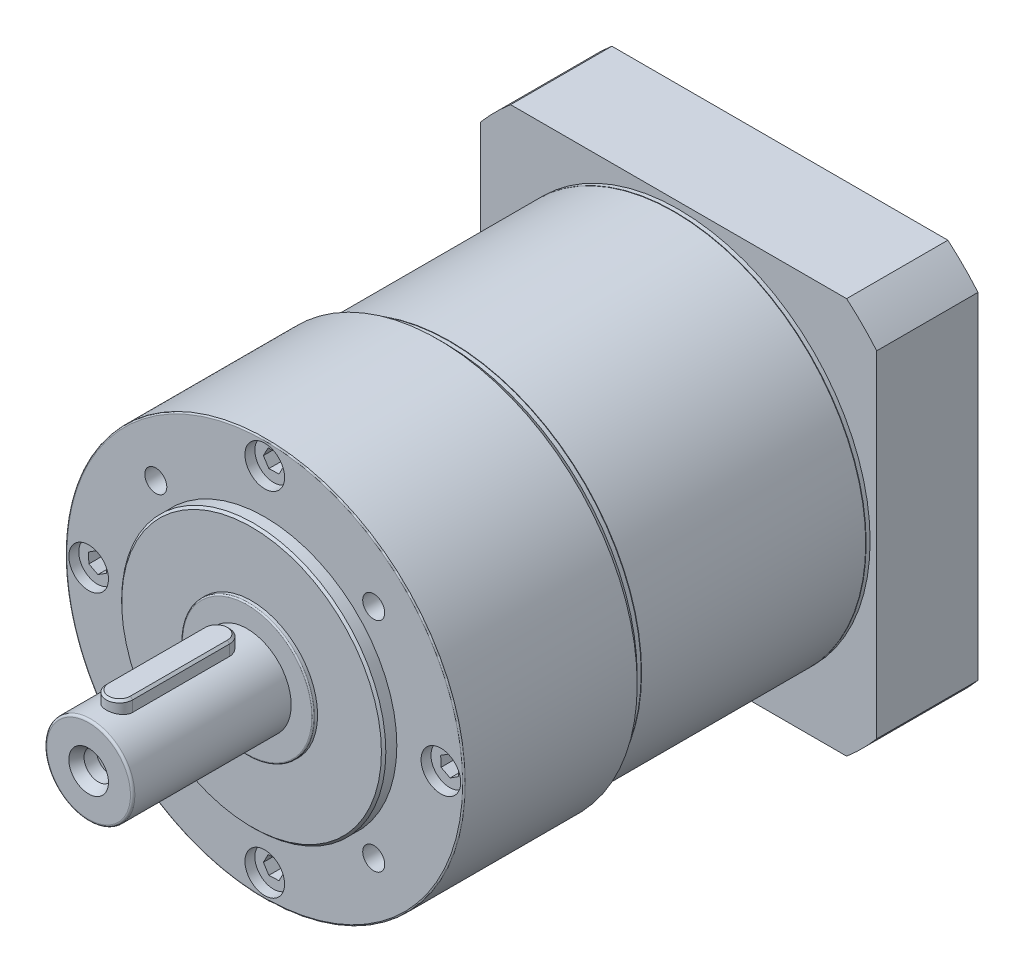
from build123d import *

# Parameters (mm, degrees)
SKETCH_1_R               = 45.25
EXTRUDE_1_DEPTH          = 42
SKETCH_2_R               = 30
EXTRUDE_2_DEPTH          = 3
SKETCH_3_OUTSIDE_W       = 119.634
SKETCH_3_OUTSIDE_H       = 119.634
SKETCH_3_OUTSIDE_R       = 43.5
CUT_EXTRUDE_1_DEPTH      = 1
CHAMFER_1_SIZE           = 1.65
FILLET_1_R               = 0.3
SKETCH_4_R               = 43.5
EXTRUDE_3_DEPTH          = 50.9
SKETCH_5_R               = 43.5
EXTRUDE_4_DEPTH          = 0.9
EXTRUDE_5_DEPTH          = 23
SKETCH_7_R               = 35
CUT_EXTRUDE_2_DEPTH      = 6
SKETCH_8_R               = 32
CUT_EXTRUDE_3_DEPTH      = 20
SKETCH_9_R               = 4.5
CUT_EXTRUDE_4_DEPTH      = 14
PATTERN_CIRCULAR_1_COUNT = 4
PATTERN_CIRCULAR_2_COUNT = 4
SKETCH_12_R              = 4.25
EXTRUDE_6_DEPTH          = 5
PATTERN_CIRCULAR_3_COUNT = 4
SKETCH_13_R              = 4.5
CUT_EXTRUDE_5_DEPTH      = 7
PATTERN_CIRCULAR_4_COUNT = 4
SKETCH_14_R              = 4.25
EXTRUDE_7_DEPTH          = 5
PATTERN_CIRCULAR_5_COUNT = 4
PATTERN_CIRCULAR_6_COUNT = 4
SKETCH_17_R              = 26
EXTRUDE_8_DEPTH          = 19
CHAMFER_2_SIZE           = 1.5
SKETCH_18_W              = 61.385276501
SKETCH_18_H              = 1
CUT_EXTRUDE_6_DEPTH      = 19
SKETCH_19_R              = 9.5
CUT_EXTRUDE_7_DEPTH      = 42
CHAMFER_3_SIZE           = 0.5
SKETCH_20_R              = 15
EXTRUDE_9_DEPTH          = 1
FILLET_2_R               = 0.3
SKETCH_22_R              = 10
EXTRUDE_10_DEPTH         = 36
FILLET_3_R               = 0.5
EXTRUDE_11_DEPTH         = 12.5
CHAMFER_4_SIZE           = 0.5
SKETCH_24_R              = 3.25
CUT_EXTRUDE_8_DEPTH      = 5
SKETCH_26_R              = 3.25
SKETCH_25_R              = 4.5


with BuildPart() as part:
    # Sketch 1 → Extrude 1 (new body)
    with BuildSketch(Plane.XY):
        with Locations(Location((0, 0, 0), (0, 0, 180))):
            Circle(SKETCH_1_R)
    extrude(amount=EXTRUDE_1_DEPTH)

    # Sketch 2 → Extrude 2 (add)
    with BuildSketch(Plane.XY.offset(42)):
        Circle(SKETCH_2_R)
    extrude(amount=EXTRUDE_2_DEPTH)

    # Sketch 3 outside → Cut-Extrude 1 (cut)
    with BuildSketch(Plane(origin=(0, 0, 0), x_dir=(-1, 0, 0), z_dir=(0, 0, -1))):
        Rectangle(SKETCH_3_OUTSIDE_W, SKETCH_3_OUTSIDE_H)
        Circle(SKETCH_3_OUTSIDE_R, mode=Mode.SUBTRACT)
    extrude(amount=-CUT_EXTRUDE_1_DEPTH, mode=Mode.SUBTRACT)

    # Chamfer 1
    chamfer_1_edges = [part.edges().sort_by_distance(p)[0] for p in [
        (45.25, 0, 1),
    ]]
    chamfer(chamfer_1_edges, length=CHAMFER_1_SIZE)

    # Fillet 1
    fillet_1_edges = [part.edges().sort_by_distance(p)[0] for p in [
        (45.25, 0, 42),
    ]]
    fillet(fillet_1_edges, radius=FILLET_1_R)

    # Sketch 13 → Cut-Extrude 5 (cut)
    with BuildSketch(Plane.XY.offset(42)):
        with Locations((0, -40)):
            Circle(SKETCH_13_R)
    cut_extrude_5 = extrude(amount=-CUT_EXTRUDE_5_DEPTH, mode=Mode.SUBTRACT)

    # Pattern Circular 4: Cut-Extrude 5 ×4 about axis
    pattern_circular_4_axis = Axis((0, 0, 0), (0, 0, 1))
    for i in range(1, PATTERN_CIRCULAR_4_COUNT):
        add(cut_extrude_5.rotate(pattern_circular_4_axis, i * 360 / PATTERN_CIRCULAR_4_COUNT), mode=Mode.SUBTRACT)

    # Sketch 14 → Extrude 7 (add)
    with BuildSketch(Plane.XY.offset(35)):
        with Locations((0, -40)):
            Circle(SKETCH_14_R)
        Polygon((1.070164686, -37.953519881), (-1.237221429, -38.049970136), (-2.307386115, -40.096450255), (-1.070164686, -42.046480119), (1.237221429, -41.950029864), (2.307386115, -39.903549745), align=None, mode=Mode.SUBTRACT)
    extrude_7 = extrude(amount=EXTRUDE_7_DEPTH)

    # Pattern Circular 5: Extrude 7 ×4 about axis
    pattern_circular_5_axis = Axis((0, 0, 0), (0, 0, 1))
    for i in range(1, PATTERN_CIRCULAR_5_COUNT):
        add(extrude_7.rotate(pattern_circular_5_axis, i * 360 / PATTERN_CIRCULAR_5_COUNT))

    # Sketch 16 → Hole Wizard M6 _1 (revolve, cut)
    with BuildSketch(Plane(origin=(-24.748737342, 24.748737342, 42), x_dir=(0, -1, 0), z_dir=(1, 0, 0))):
        Polygon((0, 0), (0, 18.502151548), (2.5, 17), (2.5, 0), align=None)
    hole_wizard_m6_1 = revolve(axis=Axis((-24.748737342, 24.748737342, 48.35), (0, 0, -1)), mode=Mode.SUBTRACT)

    # Pattern Circular 6: Hole Wizard M6 _1 ×4 about axis
    pattern_circular_6_axis = Axis((0, 0, 0), (0, 0, 1))
    for i in range(1, PATTERN_CIRCULAR_6_COUNT):
        add(hole_wizard_m6_1.rotate(pattern_circular_6_axis, i * 360 / PATTERN_CIRCULAR_6_COUNT), mode=Mode.SUBTRACT)

    # Chamfer 3
    chamfer_3_edges = [part.edges().sort_by_distance(p)[0] for p in [
        (-30, 0, 45),
    ]]
    chamfer(chamfer_3_edges, length=CHAMFER_3_SIZE)

    # Sketch 20 → Extrude 9 (add)
    with BuildSketch(Plane.XY.offset(45)):
        Circle(SKETCH_20_R)
    extrude(amount=EXTRUDE_9_DEPTH)

    # Fillet 2
    fillet_2_edges = [part.edges().sort_by_distance(p)[0] for p in [
        (-15, 0, 46),
    ]]
    fillet(fillet_2_edges, radius=FILLET_2_R)

    # Sketch 22 → Extrude 10 (add)
    with BuildSketch(Plane.XY.offset(46)):
        Circle(SKETCH_22_R)
    extrude(amount=EXTRUDE_10_DEPTH)

    # Fillet 3
    fillet_3_edges = [part.edges().sort_by_distance(p)[0] for p in [
        (-10, 0, 82),
    ]]
    fillet(fillet_3_edges, radius=FILLET_3_R)

    # Sketch 23 → Extrude 11 (add)
    with BuildSketch(Plane(origin=(0, 0, 0), x_dir=(1, 0, 0), z_dir=(0, 1, 0))):
        with BuildLine():
            Line((-3, -53), (-3, -75))
            ThreePointArc((-3, -75), (0, -78), (3, -75))
            Line((3, -75), (3, -53))
            ThreePointArc((3, -53), (0, -50), (-3, -53))
        make_face()
    extrude(amount=EXTRUDE_11_DEPTH)

    # Chamfer 4
    chamfer_4_edges = [part.edges().sort_by_distance(p)[0] for p in [
        (0, 12.5, 50),
        (-3, 12.5, 64),
        (0, 12.5, 78),
        (3, 12.5, 64),
    ]]
    chamfer(chamfer_4_edges, length=CHAMFER_4_SIZE)

    # Sketch 24 → Cut-Extrude 8 (cut)
    with BuildSketch(Plane.XY.offset(82)):
        Circle(SKETCH_24_R)
    extrude(amount=-CUT_EXTRUDE_8_DEPTH, mode=Mode.SUBTRACT)

    # Sketch 26 → Loft 1 section 0
    with BuildSketch(Plane.XY.offset(79.8)):
        Circle(SKETCH_26_R)
    # Sketch 25 → Loft 1 section 1
    with BuildSketch(Plane.XY.offset(82)):
        Circle(SKETCH_25_R)
    loft(mode=Mode.SUBTRACT)

    # Sketch 27 → Hole Wizard M6 _2 (revolve, cut)
    with BuildSketch(Plane(origin=(0, 0, 77), x_dir=(0, -1, 0), z_dir=(1, 0, 0))):
        Polygon((0, 0), (0, 18.002151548), (2.5, 16.5), (2.5, 0), align=None)
    revolve(axis=Axis((0, 0, 83.35), (0, 0, -1)), mode=Mode.SUBTRACT)


with BuildPart() as body_2:
    # Sketch 4 → Extrude 3 (new body)
    with BuildSketch(Plane(origin=(0, 0, -0.1), x_dir=(-1, 0, 0), z_dir=(0, 0, -1))):
        with Locations(Location((0, 0, 0), (0, 0, 180))):
            Circle(SKETCH_4_R)
    extrude(amount=EXTRUDE_3_DEPTH)


with BuildPart() as body_3:
    # Sketch 5 → Extrude 4 (new body)
    with BuildSketch(Plane(origin=(0, 0, -51.1), x_dir=(-1, 0, 0), z_dir=(0, 0, -1))):
        Circle(SKETCH_5_R)
    extrude(amount=EXTRUDE_4_DEPTH)

    # Sketch 6 → Extrude 5 (add)
    with BuildSketch(Plane(origin=(0, 0, -52), x_dir=(-1, 0, 0), z_dir=(0, 0, -1))):
        with BuildLine():
            Line((-38.157568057, 45), (38.157568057, 45))
            ThreePointArc((38.157568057, 45), (41.71930009, 41.71930009), (45, 38.157568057))
            Line((45, 38.157568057), (45, -38.157568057))
            ThreePointArc((45, -38.157568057), (41.71930009, -41.71930009), (38.157568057, -45))
            Line((38.157568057, -45), (-38.157568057, -45))
            ThreePointArc((-38.157568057, -45), (-41.71930009, -41.71930009), (-45, -38.157568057))
            Line((-45, -38.157568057), (-45, 38.157568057))
            ThreePointArc((-45, 38.157568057), (-41.71930009, 41.71930009), (-38.157568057, 45))
        make_face()
    extrude(amount=EXTRUDE_5_DEPTH)

    # Sketch 7 → Cut-Extrude 2 (cut)
    with BuildSketch(Plane(origin=(0, 0, -75), x_dir=(-1, 0, 0), z_dir=(0, 0, -1))):
        Circle(SKETCH_7_R)
    extrude(amount=-CUT_EXTRUDE_2_DEPTH, mode=Mode.SUBTRACT)


with BuildPart() as cut_extrude_3_tool:
    # Sketch 8 → Cut-Extrude 3 (new body)
    with BuildSketch(Plane(origin=(0, 0, -69), x_dir=(-1, 0, 0), z_dir=(0, 0, -1))):
        Circle(SKETCH_8_R)
    extrude(amount=-CUT_EXTRUDE_3_DEPTH)


with BuildPart() as body_2_1:
    add(body_2.part)

    # Cut-Extrude 3: cut by cut_extrude_3_tool
    add(cut_extrude_3_tool.part, mode=Mode.SUBTRACT)

    # Sketch 17 → Extrude 8 (add)
    with BuildSketch(Plane(origin=(0, 0, -68), x_dir=(-1, 0, 0), z_dir=(0, 0, -1))):
        Circle(SKETCH_17_R)
    extrude(amount=-EXTRUDE_8_DEPTH)

    # Chamfer 2
    chamfer_2_edges = [body_2_1.edges().sort_by_distance(p)[0] for p in [
        (26, 0, -68),
    ]]
    chamfer(chamfer_2_edges, length=CHAMFER_2_SIZE)

    # Sketch 18 → Cut-Extrude 6 (cut)
    with BuildSketch(Plane(origin=(0, 0, -68), x_dir=(-1, 0, 0), z_dir=(0, 0, -1))):
        with Locations((0.110137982, 0)):
            Rectangle(SKETCH_18_W, SKETCH_18_H)
    extrude(amount=-CUT_EXTRUDE_6_DEPTH, mode=Mode.SUBTRACT)

    # Sketch 19 → Cut-Extrude 7 (cut)
    with BuildSketch(Plane(origin=(0, 0, -75), x_dir=(-1, 0, 0), z_dir=(0, 0, -1))):
        Circle(SKETCH_19_R)
    extrude(amount=-CUT_EXTRUDE_7_DEPTH, mode=Mode.SUBTRACT)


with BuildPart() as body_3_1:
    add(body_3.part)

    # Cut-Extrude 3: cut by cut_extrude_3_tool
    add(cut_extrude_3_tool.part, mode=Mode.SUBTRACT)

    # Sketch 9 → Cut-Extrude 4 (cut)
    with BuildSketch(Plane(origin=(0, 0, -75), x_dir=(-1, 0, 0), z_dir=(0, 0, -1))):
        with Locations((-13.680805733, 37.587704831)):
            Circle(SKETCH_9_R)
    cut_extrude_4 = extrude(amount=-CUT_EXTRUDE_4_DEPTH, mode=Mode.SUBTRACT)

    # Pattern Circular 1: Cut-Extrude 4 ×4 about axis
    pattern_circular_1_axis = Axis((0, 0, 0), (0, 0, 1))
    for i in range(1, PATTERN_CIRCULAR_1_COUNT):
        add(cut_extrude_4.rotate(pattern_circular_1_axis, i * 360 / PATTERN_CIRCULAR_1_COUNT), mode=Mode.SUBTRACT)

    # Sketch 11 → Hole Wizard M5 _1 (revolve, cut)
    with BuildSketch(Plane(origin=(31.819805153, 31.819805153, -75), x_dir=(0, 1, 0), z_dir=(1, 0, 0))):
        Polygon((0, 0), (0, 17.2618073), (2.1, 16), (2.1, 0), align=None)
    hole_wizard_m5_1 = revolve(axis=Axis((31.819805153, 31.819805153, -81.35), (0, 0, 1)), mode=Mode.SUBTRACT)

    # Pattern Circular 2: Hole Wizard M5 _1 ×4 about axis
    pattern_circular_2_axis = Axis((0, 0, 0), (0, 0, 1))
    for i in range(1, PATTERN_CIRCULAR_2_COUNT):
        add(hole_wizard_m5_1.rotate(pattern_circular_2_axis, i * 360 / PATTERN_CIRCULAR_2_COUNT), mode=Mode.SUBTRACT)

    # Sketch 12 → Extrude 6 (add)
    with BuildSketch(Plane(origin=(0, 0, -61), x_dir=(-1, 0, 0), z_dir=(0, 0, -1))):
        with Locations((-13.680805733, 37.587704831)):
            Circle(SKETCH_12_R)
        Polygon((-12.613258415, 39.635551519), (-14.920519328, 39.536151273), (-15.988066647, 37.488304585), (-14.748353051, 35.539858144), (-12.441092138, 35.63925839), (-11.373544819, 37.687105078), align=None, mode=Mode.SUBTRACT)
    extrude_6 = extrude(amount=EXTRUDE_6_DEPTH)

    # Pattern Circular 3: Extrude 6 ×4 about axis
    pattern_circular_3_axis = Axis((0, 0, 0), (0, 0, 1))
    for i in range(1, PATTERN_CIRCULAR_3_COUNT):
        add(extrude_6.rotate(pattern_circular_3_axis, i * 360 / PATTERN_CIRCULAR_3_COUNT))


solid = Compound([part.part, body_2_1.part, body_3_1.part])
